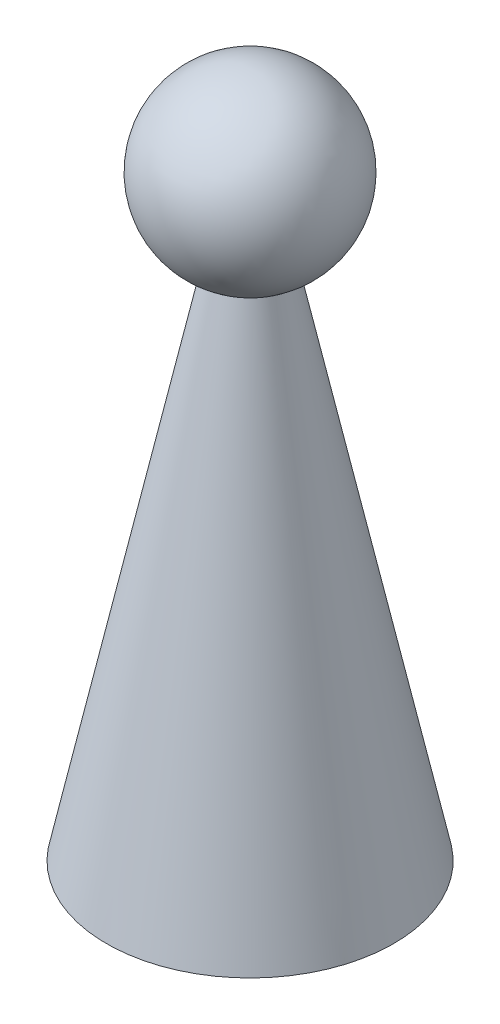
ISO-10303-21;
HEADER;
FILE_DESCRIPTION(('STEP AP214'),'2;1');
FILE_NAME('part.step','',(''),(''),'','','');
FILE_SCHEMA(('AUTOMOTIVE_DESIGN { 1 0 10303 214 1 1 1 1 }'));
ENDSEC;
DATA;
#1=APPLICATION_CONTEXT('core data for automotive mechanical design processes');
#2=APPLICATION_PROTOCOL_DEFINITION('international standard','automotive_design',2000,#1);
#3=PRODUCT_CONTEXT('',#1,'mechanical');
#4=PRODUCT('Part','Part','',(#3));
#5=PRODUCT_RELATED_PRODUCT_CATEGORY('part','',(#4));
#6=PRODUCT_DEFINITION_FORMATION('','',#4);
#7=PRODUCT_DEFINITION_CONTEXT('part definition',#1,'design');
#8=PRODUCT_DEFINITION('design','',#6,#7);
#9=PRODUCT_DEFINITION_SHAPE('','',#8);
#10=(LENGTH_UNIT() NAMED_UNIT(*) SI_UNIT(.MILLI.,.METRE.));
#11=(NAMED_UNIT(*) PLANE_ANGLE_UNIT() SI_UNIT($,.RADIAN.));
#12=(NAMED_UNIT(*) SI_UNIT($,.STERADIAN.) SOLID_ANGLE_UNIT());
#13=UNCERTAINTY_MEASURE_WITH_UNIT(LENGTH_MEASURE(1.E-05),#10,'distance_accuracy_value','');
#14=(GEOMETRIC_REPRESENTATION_CONTEXT(3) GLOBAL_UNCERTAINTY_ASSIGNED_CONTEXT((#13)) GLOBAL_UNIT_ASSIGNED_CONTEXT((#10,
#11,#12)) REPRESENTATION_CONTEXT('',''));
#15=CARTESIAN_POINT('',(0.,0.,0.));
#16=DIRECTION('',(0.,0.,1.));
#17=DIRECTION('',(1.,0.,0.));
#18=AXIS2_PLACEMENT_3D('',#15,#16,#17);
#19=CARTESIAN_POINT('',(0.,0.,0.));
#20=DIRECTION('',(0.,-1.,0.));
#21=DIRECTION('',(0.,0.,-1.));
#22=AXIS2_PLACEMENT_3D('',#19,#20,#21);
#23=CONICAL_SURFACE('',#22,209.417421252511,0.209439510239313);
#24=CARTESIAN_POINT('',(0.,750.,0.));
#25=DIRECTION('',(0.,1.,0.));
#26=DIRECTION('',(0.,0.,1.));
#27=AXIS2_PLACEMENT_3D('',#24,#25,#26);
#28=CIRCLE('',#27,50.0000000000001);
#29=CARTESIAN_POINT('',(0.,750.,-50.));
#30=VERTEX_POINT('',#29);
#31=EDGE_CURVE('E43',#30,#30,#28,.T.);
#32=CARTESIAN_POINT('',(0.,0.,0.));
#33=DIRECTION('',(0.,1.,0.));
#34=DIRECTION('',(0.,0.,1.));
#35=AXIS2_PLACEMENT_3D('',#32,#33,#34);
#36=CIRCLE('',#35,209.417421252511);
#37=CARTESIAN_POINT('',(0.,0.,-209.417421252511));
#38=VERTEX_POINT('',#37);
#39=EDGE_CURVE('E10',#38,#38,#36,.T.);
#40=CARTESIAN_POINT('',(0.,750.,-50.));
#41=CARTESIAN_POINT('',(0.,742.1875,-51.6605981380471));
#42=CARTESIAN_POINT('',(0.,734.375,-53.321196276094));
#43=CARTESIAN_POINT('',(0.,718.75,-56.642392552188));
#44=CARTESIAN_POINT('',(0.,710.9375,-58.302990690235));
#45=CARTESIAN_POINT('',(0.,695.3125,-61.624186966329));
#46=CARTESIAN_POINT('',(0.,687.5,-63.284785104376));
#47=CARTESIAN_POINT('',(0.,671.875,-66.60598138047));
#48=CARTESIAN_POINT('',(0.,664.0625,-68.266579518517));
#49=CARTESIAN_POINT('',(0.,648.4375,-71.5877757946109));
#50=CARTESIAN_POINT('',(0.,640.625,-73.2483739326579));
#51=CARTESIAN_POINT('',(0.,625.,-76.5695702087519));
#52=CARTESIAN_POINT('',(0.,617.1875,-78.2301683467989));
#53=CARTESIAN_POINT('',(0.,601.5625,-81.5513646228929));
#54=CARTESIAN_POINT('',(0.,593.75,-83.2119627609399));
#55=CARTESIAN_POINT('',(0.,578.125,-86.5331590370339));
#56=CARTESIAN_POINT('',(0.,570.3125,-88.1937571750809));
#57=CARTESIAN_POINT('',(0.,554.6875,-91.5149534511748));
#58=CARTESIAN_POINT('',(0.,546.875,-93.1755515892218));
#59=CARTESIAN_POINT('',(0.,531.25,-96.4967478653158));
#60=CARTESIAN_POINT('',(0.,523.4375,-98.1573460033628));
#61=CARTESIAN_POINT('',(0.,507.8125,-101.478542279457));
#62=CARTESIAN_POINT('',(0.,500.,-103.139140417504));
#63=CARTESIAN_POINT('',(0.,484.375,-106.460336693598));
#64=CARTESIAN_POINT('',(0.,476.5625,-108.120934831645));
#65=CARTESIAN_POINT('',(0.,460.9375,-111.442131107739));
#66=CARTESIAN_POINT('',(0.,453.125,-113.102729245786));
#67=CARTESIAN_POINT('',(0.,437.5,-116.42392552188));
#68=CARTESIAN_POINT('',(0.,429.6875,-118.084523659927));
#69=CARTESIAN_POINT('',(0.,414.0625,-121.405719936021));
#70=CARTESIAN_POINT('',(0.,406.25,-123.066318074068));
#71=CARTESIAN_POINT('',(0.,390.625,-126.387514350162));
#72=CARTESIAN_POINT('',(0.,382.8125,-128.048112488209));
#73=CARTESIAN_POINT('',(0.,367.1875,-131.369308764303));
#74=CARTESIAN_POINT('',(0.,359.375,-133.02990690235));
#75=CARTESIAN_POINT('',(0.,343.75,-136.351103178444));
#76=CARTESIAN_POINT('',(0.,335.9375,-138.011701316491));
#77=CARTESIAN_POINT('',(0.,320.3125,-141.332897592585));
#78=CARTESIAN_POINT('',(0.,312.5,-142.993495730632));
#79=CARTESIAN_POINT('',(0.,296.875,-146.314692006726));
#80=CARTESIAN_POINT('',(0.,289.0625,-147.975290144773));
#81=CARTESIAN_POINT('',(0.,273.4375,-151.296486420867));
#82=CARTESIAN_POINT('',(0.,265.625,-152.957084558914));
#83=CARTESIAN_POINT('',(0.,250.,-156.278280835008));
#84=CARTESIAN_POINT('',(0.,242.1875,-157.938878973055));
#85=CARTESIAN_POINT('',(0.,226.5625,-161.260075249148));
#86=CARTESIAN_POINT('',(0.,218.75,-162.920673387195));
#87=CARTESIAN_POINT('',(0.,203.125,-166.241869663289));
#88=CARTESIAN_POINT('',(0.,195.3125,-167.902467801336));
#89=CARTESIAN_POINT('',(0.,179.6875,-171.22366407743));
#90=CARTESIAN_POINT('',(0.,171.875,-172.884262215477));
#91=CARTESIAN_POINT('',(0.,156.25,-176.205458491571));
#92=CARTESIAN_POINT('',(0.,148.4375,-177.866056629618));
#93=CARTESIAN_POINT('',(0.,132.8125,-181.187252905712));
#94=CARTESIAN_POINT('',(0.,125.,-182.847851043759));
#95=CARTESIAN_POINT('',(0.,109.375,-186.169047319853));
#96=CARTESIAN_POINT('',(0.,101.5625,-187.8296454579));
#97=CARTESIAN_POINT('',(0.,85.9375,-191.150841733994));
#98=CARTESIAN_POINT('',(0.,78.125,-192.811439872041));
#99=CARTESIAN_POINT('',(0.,62.5,-196.132636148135));
#100=CARTESIAN_POINT('',(0.,54.6875,-197.793234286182));
#101=CARTESIAN_POINT('',(0.,39.0625,-201.114430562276));
#102=CARTESIAN_POINT('',(0.,31.25,-202.775028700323));
#103=CARTESIAN_POINT('',(0.,15.625,-206.096224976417));
#104=CARTESIAN_POINT('',(0.,7.81249999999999,-207.756823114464));
#105=CARTESIAN_POINT('',(0.,0.,-209.417421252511));
#106=B_SPLINE_CURVE_WITH_KNOTS('',3,(#40,#41,#42,#43,#44,#45,#46,#47,#48,#49,#50,#51,#52,#53,
#54,#55,#56,#57,#58,#59,#60,#61,#62,#63,#64,#65,#66,#67,#68,#69,#70,#71,#72,#73,#74,#75,#76,#77,
#78,#79,#80,#81,#82,#83,#84,#85,#86,#87,#88,#89,#90,#91,#92,#93,#94,#95,#96,#97,#98,#99,#100,
#101,#102,#103,#104,#105),.UNSPECIFIED.,.F.,.F.,(4,2,2,2,2,2,2,2,2,2,2,2,2,2,2,2,2,2,2,2,2,2,2,
2,2,2,2,2,2,2,2,2,4),(0.,23.9611076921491,47.9222153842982,71.8833230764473,95.8444307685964,
119.805538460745,143.766646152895,167.727753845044,191.688861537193,215.649969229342,
239.611076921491,263.57218461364,287.533292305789,311.494399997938,335.455507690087,
359.416615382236,383.377723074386,407.338830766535,431.299938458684,455.261046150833,
479.222153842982,503.183261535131,527.14436922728,551.105476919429,575.066584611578,
599.027692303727,622.988799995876,646.949907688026,670.911015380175,694.872123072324,
718.833230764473,742.794338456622,766.755446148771),.UNSPECIFIED.);
#107=EDGE_CURVE('BSEAM37',#30,#38,#106,.T.);
#108=ORIENTED_EDGE('',*,*,#31,.F.);
#109=ORIENTED_EDGE('',*,*,#39,.T.);
#110=ORIENTED_EDGE('',*,*,#107,.T.);
#111=ORIENTED_EDGE('',*,*,#107,.F.);
#112=EDGE_LOOP('',(#108,#110,#109,#111));
#113=FACE_BOUND('',#112,.T.);
#114=ADVANCED_FACE('F37',(#113),#23,.T.);
#115=CARTESIAN_POINT('',(209.417421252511,0.,0.));
#116=DIRECTION('',(0.,1.,0.));
#117=DIRECTION('',(0.,0.,1.));
#118=AXIS2_PLACEMENT_3D('',#115,#116,#117);
#119=PLANE('',#118);
#120=ORIENTED_EDGE('',*,*,#39,.F.);
#121=EDGE_LOOP('',(#120));
#122=FACE_BOUND('',#121,.T.);
#123=ADVANCED_FACE('F52',(#122),#119,.F.);
#124=CARTESIAN_POINT('',(0.,870.,0.));
#125=DIRECTION('',(0.,1.,0.));
#126=DIRECTION('',(1.,0.,0.));
#127=AXIS2_PLACEMENT_3D('',#124,#125,#126);
#128=SPHERICAL_SURFACE('',#127,130.);
#129=ORIENTED_EDGE('',*,*,#31,.T.);
#130=EDGE_LOOP('',(#129));
#131=FACE_BOUND('',#130,.T.);
#132=ADVANCED_FACE('F49',(#131),#128,.T.);
#133=CLOSED_SHELL('',(#114,#123,#132));
#134=MANIFOLD_SOLID_BREP('B2',#133);
#135=ADVANCED_BREP_SHAPE_REPRESENTATION('',(#18,#134),#14);
#136=SHAPE_DEFINITION_REPRESENTATION(#9,#135);
ENDSEC;
END-ISO-10303-21;
